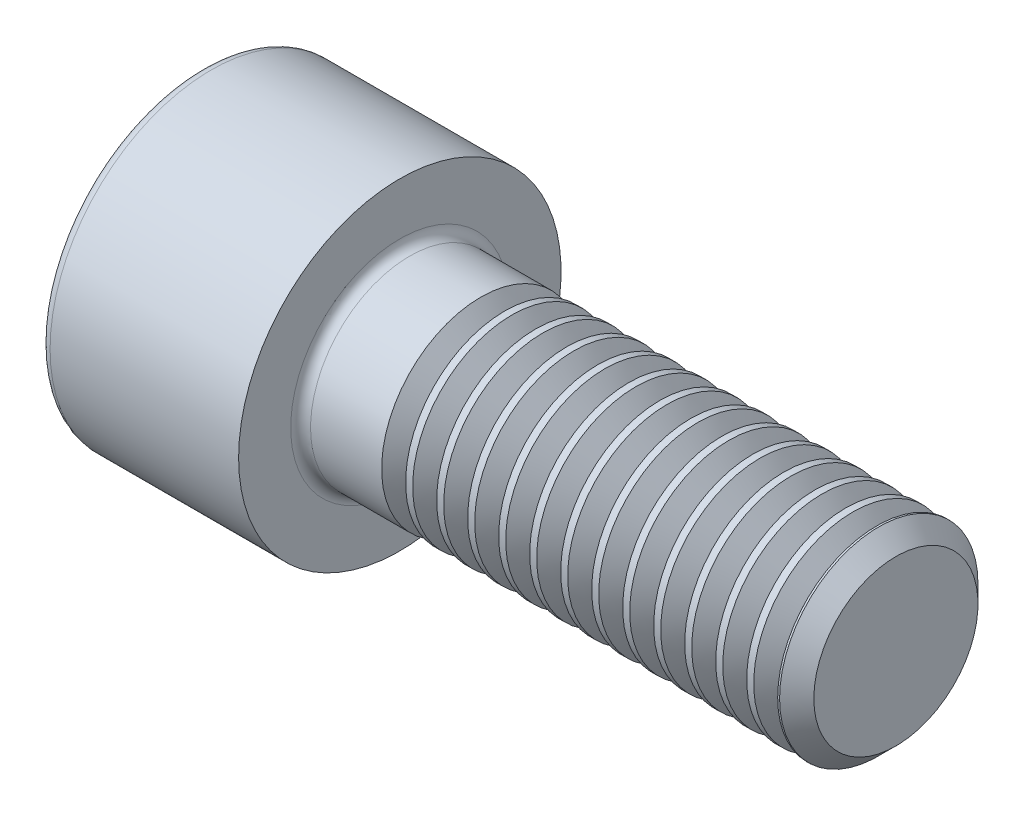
ISO-10303-21;
HEADER;
FILE_DESCRIPTION(('STEP AP214'),'2;1');
FILE_NAME('part.step','',(''),(''),'','','');
FILE_SCHEMA(('AUTOMOTIVE_DESIGN { 1 0 10303 214 1 1 1 1 }'));
ENDSEC;
DATA;
#1=APPLICATION_CONTEXT('core data for automotive mechanical design processes');
#2=APPLICATION_PROTOCOL_DEFINITION('international standard','automotive_design',2000,#1);
#3=PRODUCT_CONTEXT('',#1,'mechanical');
#4=PRODUCT('Part','Part','',(#3));
#5=PRODUCT_RELATED_PRODUCT_CATEGORY('part','',(#4));
#6=PRODUCT_DEFINITION_FORMATION('','',#4);
#7=PRODUCT_DEFINITION_CONTEXT('part definition',#1,'design');
#8=PRODUCT_DEFINITION('design','',#6,#7);
#9=PRODUCT_DEFINITION_SHAPE('','',#8);
#10=(LENGTH_UNIT() NAMED_UNIT(*) SI_UNIT(.MILLI.,.METRE.));
#11=(NAMED_UNIT(*) PLANE_ANGLE_UNIT() SI_UNIT($,.RADIAN.));
#12=(NAMED_UNIT(*) SI_UNIT($,.STERADIAN.) SOLID_ANGLE_UNIT());
#13=UNCERTAINTY_MEASURE_WITH_UNIT(LENGTH_MEASURE(1.E-05),#10,'distance_accuracy_value','');
#14=(GEOMETRIC_REPRESENTATION_CONTEXT(3) GLOBAL_UNCERTAINTY_ASSIGNED_CONTEXT((#13)) GLOBAL_UNIT_ASSIGNED_CONTEXT((#10,
#11,#12)) REPRESENTATION_CONTEXT('',''));
#15=CARTESIAN_POINT('',(0.,0.,0.));
#16=DIRECTION('',(0.,0.,1.));
#17=DIRECTION('',(1.,0.,0.));
#18=AXIS2_PLACEMENT_3D('',#15,#16,#17);
#19=CARTESIAN_POINT('',(0.,0.,0.));
#20=DIRECTION('',(-1.,0.,0.));
#21=DIRECTION('',(0.,0.,1.));
#22=AXIS2_PLACEMENT_3D('',#19,#20,#21);
#23=PLANE('',#22);
#24=DIRECTION('',(0.,-0.499999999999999,0.866025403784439));
#25=VECTOR('',#24,1.);
#26=CARTESIAN_POINT('',(0.,3.51894989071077,0.));
#27=LINE('',#26,#25);
#28=CARTESIAN_POINT('',(0.,3.51894989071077,0.));
#29=VERTEX_POINT('',#28);
#30=CARTESIAN_POINT('',(0.,1.75947494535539,3.04749999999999));
#31=VERTEX_POINT('',#30);
#32=EDGE_CURVE('E110',#29,#31,#27,.T.);
#33=ORIENTED_EDGE('',*,*,#32,.T.);
#34=DIRECTION('',(0.,1.,0.));
#35=VECTOR('',#34,1.);
#36=CARTESIAN_POINT('',(0.,-1.75947494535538,3.0475));
#37=LINE('',#36,#35);
#38=CARTESIAN_POINT('',(0.,-1.75947494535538,3.0475));
#39=VERTEX_POINT('',#38);
#40=EDGE_CURVE('E99',#39,#31,#37,.T.);
#41=ORIENTED_EDGE('',*,*,#40,.F.);
#42=DIRECTION('',(0.,-0.500000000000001,-0.866025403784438));
#43=VECTOR('',#42,1.);
#44=CARTESIAN_POINT('',(0.,-1.75947494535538,3.0475));
#45=LINE('',#44,#43);
#46=CARTESIAN_POINT('',(0.,-3.51894989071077,0.));
#47=VERTEX_POINT('',#46);
#48=EDGE_CURVE('E109',#39,#47,#45,.T.);
#49=ORIENTED_EDGE('',*,*,#48,.T.);
#50=DIRECTION('',(0.,0.499999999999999,-0.866025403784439));
#51=VECTOR('',#50,1.);
#52=CARTESIAN_POINT('',(0.,-3.51894989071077,0.));
#53=LINE('',#52,#51);
#54=CARTESIAN_POINT('',(0.,-1.75947494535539,-3.0475));
#55=VERTEX_POINT('',#54);
#56=EDGE_CURVE('E133',#47,#55,#53,.T.);
#57=ORIENTED_EDGE('',*,*,#56,.T.);
#58=DIRECTION('',(0.,-1.,0.));
#59=VECTOR('',#58,1.);
#60=CARTESIAN_POINT('',(0.,1.75947494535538,-3.04750000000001));
#61=LINE('',#60,#59);
#62=CARTESIAN_POINT('',(0.,1.75947494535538,-3.04750000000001));
#63=VERTEX_POINT('',#62);
#64=EDGE_CURVE('E136',#63,#55,#61,.T.);
#65=ORIENTED_EDGE('',*,*,#64,.F.);
#66=DIRECTION('',(0.,-0.500000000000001,-0.866025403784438));
#67=VECTOR('',#66,1.);
#68=CARTESIAN_POINT('',(0.,3.51894989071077,0.));
#69=LINE('',#68,#67);
#70=EDGE_CURVE('E124',#29,#63,#69,.T.);
#71=ORIENTED_EDGE('',*,*,#70,.F.);
#72=EDGE_LOOP('',(#33,#41,#49,#57,#65,#71));
#73=FACE_BOUND('',#72,.T.);
#74=CARTESIAN_POINT('',(0.,0.,0.));
#75=DIRECTION('',(-1.,0.,0.));
#76=DIRECTION('',(0.,0.,1.));
#77=AXIS2_PLACEMENT_3D('',#74,#75,#76);
#78=CIRCLE('',#77,6.1);
#79=CARTESIAN_POINT('',(0.,0.,6.1));
#80=VERTEX_POINT('',#79);
#81=EDGE_CURVE('E35',#80,#80,#78,.T.);
#82=ORIENTED_EDGE('',*,*,#81,.T.);
#83=EDGE_LOOP('',(#82));
#84=FACE_BOUND('',#83,.T.);
#85=ADVANCED_FACE('F28',(#73,#84),#23,.T.);
#86=CARTESIAN_POINT('',(-31.75,0.,0.));
#87=DIRECTION('',(-1.,0.,0.));
#88=DIRECTION('',(0.,0.,1.));
#89=AXIS2_PLACEMENT_3D('',#86,#87,#88);
#90=CYLINDRICAL_SURFACE('',#89,6.5);
#91=CARTESIAN_POINT('',(0.399999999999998,0.,0.));
#92=DIRECTION('',(-1.,0.,0.));
#93=DIRECTION('',(0.,0.,1.));
#94=AXIS2_PLACEMENT_3D('',#91,#92,#93);
#95=CIRCLE('',#94,6.5);
#96=CARTESIAN_POINT('',(0.399999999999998,0.,6.5));
#97=VERTEX_POINT('',#96);
#98=EDGE_CURVE('E11',#97,#97,#95,.F.);
#99=ORIENTED_EDGE('',*,*,#98,.T.);
#100=EDGE_LOOP('',(#99));
#101=FACE_BOUND('',#100,.T.);
#102=CARTESIAN_POINT('',(8.00000000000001,0.,0.));
#103=DIRECTION('',(-1.,0.,0.));
#104=DIRECTION('',(0.,0.,1.));
#105=AXIS2_PLACEMENT_3D('',#102,#103,#104);
#106=CIRCLE('',#105,6.5);
#107=CARTESIAN_POINT('',(8.00000000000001,0.,6.5));
#108=VERTEX_POINT('',#107);
#109=EDGE_CURVE('E181',#108,#108,#106,.T.);
#110=ORIENTED_EDGE('',*,*,#109,.T.);
#111=EDGE_LOOP('',(#110));
#112=FACE_BOUND('',#111,.T.);
#113=ADVANCED_FACE('F209',(#101,#112),#90,.T.);
#114=CARTESIAN_POINT('',(8.,6.5,0.));
#115=DIRECTION('',(1.,0.,0.));
#116=DIRECTION('',(0.,0.,-1.));
#117=AXIS2_PLACEMENT_3D('',#114,#115,#116);
#118=PLANE('',#117);
#119=CARTESIAN_POINT('',(8.,0.,0.));
#120=DIRECTION('',(1.,0.,0.));
#121=DIRECTION('',(0.,0.,-1.));
#122=AXIS2_PLACEMENT_3D('',#119,#120,#121);
#123=CIRCLE('',#122,4.4);
#124=CARTESIAN_POINT('',(8.,0.,-4.4));
#125=VERTEX_POINT('',#124);
#126=EDGE_CURVE('E184',#125,#125,#123,.F.);
#127=ORIENTED_EDGE('',*,*,#126,.T.);
#128=EDGE_LOOP('',(#127));
#129=FACE_BOUND('',#128,.T.);
#130=ORIENTED_EDGE('',*,*,#109,.F.);
#131=EDGE_LOOP('',(#130));
#132=FACE_BOUND('',#131,.T.);
#133=ADVANCED_FACE('F212',(#129,#132),#118,.T.);
#134=CARTESIAN_POINT('',(-31.75,0.,0.));
#135=DIRECTION('',(-1.,0.,0.));
#136=DIRECTION('',(0.,0.,1.));
#137=AXIS2_PLACEMENT_3D('',#134,#135,#136);
#138=CYLINDRICAL_SURFACE('',#137,4.);
#139=CARTESIAN_POINT('',(11.2665066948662,0.,0.));
#140=DIRECTION('',(-1.,0.,0.));
#141=DIRECTION('',(0.,-1.,0.));
#142=AXIS2_PLACEMENT_3D('',#139,#140,#141);
#143=CIRCLE('',#142,4.);
#144=CARTESIAN_POINT('',(11.2665066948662,-4.,0.));
#145=VERTEX_POINT('',#144);
#146=EDGE_CURVE('E128',#145,#145,#143,.T.);
#147=ORIENTED_EDGE('',*,*,#146,.T.);
#148=EDGE_LOOP('',(#147));
#149=FACE_BOUND('',#148,.T.);
#150=CARTESIAN_POINT('',(8.4,0.,0.));
#151=DIRECTION('',(1.,0.,0.));
#152=DIRECTION('',(0.,0.,-1.));
#153=AXIS2_PLACEMENT_3D('',#150,#151,#152);
#154=CIRCLE('',#153,4.);
#155=CARTESIAN_POINT('',(8.4,0.,-4.));
#156=VERTEX_POINT('',#155);
#157=EDGE_CURVE('E187',#156,#156,#154,.T.);
#158=ORIENTED_EDGE('',*,*,#157,.T.);
#159=EDGE_LOOP('',(#158));
#160=FACE_BOUND('',#159,.T.);
#161=ADVANCED_FACE('F204',(#149,#160),#138,.T.);
#162=CARTESIAN_POINT('',(8.4,0.,0.));
#163=DIRECTION('',(1.,0.,0.));
#164=DIRECTION('',(0.,0.,-1.));
#165=AXIS2_PLACEMENT_3D('',#162,#163,#164);
#166=TOROIDAL_SURFACE('',#165,4.4,0.4);
#167=ORIENTED_EDGE('',*,*,#157,.F.);
#168=EDGE_LOOP('',(#167));
#169=FACE_BOUND('',#168,.T.);
#170=ORIENTED_EDGE('',*,*,#126,.F.);
#171=EDGE_LOOP('',(#170));
#172=FACE_BOUND('',#171,.T.);
#173=ADVANCED_FACE('F194',(#169,#172),#166,.F.);
#174=CARTESIAN_POINT('',(0.399999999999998,0.,0.));
#175=DIRECTION('',(-1.,0.,0.));
#176=DIRECTION('',(0.,0.,1.));
#177=AXIS2_PLACEMENT_3D('',#174,#175,#176);
#178=TOROIDAL_SURFACE('',#177,6.1,0.4);
#179=ORIENTED_EDGE('',*,*,#98,.F.);
#180=EDGE_LOOP('',(#179));
#181=FACE_BOUND('',#180,.T.);
#182=ORIENTED_EDGE('',*,*,#81,.F.);
#183=EDGE_LOOP('',(#182));
#184=FACE_BOUND('',#183,.T.);
#185=ADVANCED_FACE('F192',(#181,#184),#178,.T.);
#186=CARTESIAN_POINT('',(4.,3.51894989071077,0.));
#187=DIRECTION('',(0.,-0.866025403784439,-0.499999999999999));
#188=DIRECTION('',(0.,0.499999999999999,-0.866025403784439));
#189=AXIS2_PLACEMENT_3D('',#186,#187,#188);
#190=PLANE('',#189);
#191=ORIENTED_EDGE('',*,*,#32,.F.);
#192=DIRECTION('',(-1.,0.,0.));
#193=VECTOR('',#192,1.);
#194=CARTESIAN_POINT('',(4.,3.51894989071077,0.));
#195=LINE('',#194,#193);
#196=CARTESIAN_POINT('',(4.,3.51894989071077,0.));
#197=VERTEX_POINT('',#196);
#198=EDGE_CURVE('E159',#197,#29,#195,.T.);
#199=ORIENTED_EDGE('',*,*,#198,.F.);
#200=DIRECTION('',(0.,-0.499999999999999,0.866025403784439));
#201=VECTOR('',#200,1.);
#202=CARTESIAN_POINT('',(4.,3.51894989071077,0.));
#203=LINE('',#202,#201);
#204=CARTESIAN_POINT('',(4.,2.63921241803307,1.52374999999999));
#205=VERTEX_POINT('',#204);
#206=EDGE_CURVE('E139',#197,#205,#203,.T.);
#207=ORIENTED_EDGE('',*,*,#206,.T.);
#208=CARTESIAN_POINT('',(4.,1.75947494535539,3.04749999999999));
#209=VERTEX_POINT('',#208);
#210=EDGE_CURVE('E118',#205,#209,#203,.T.);
#211=ORIENTED_EDGE('',*,*,#210,.T.);
#212=DIRECTION('',(-1.,0.,0.));
#213=VECTOR('',#212,1.);
#214=CARTESIAN_POINT('',(4.,1.75947494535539,3.04749999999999));
#215=LINE('',#214,#213);
#216=EDGE_CURVE('E103',#209,#31,#215,.T.);
#217=ORIENTED_EDGE('',*,*,#216,.T.);
#218=EDGE_LOOP('',(#191,#199,#207,#211,#217));
#219=FACE_BOUND('',#218,.T.);
#220=ADVANCED_FACE('F114',(#219),#190,.T.);
#221=CARTESIAN_POINT('',(4.,-1.75947494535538,3.0475));
#222=DIRECTION('',(0.,0.,1.));
#223=DIRECTION('',(0.,-1.,0.));
#224=AXIS2_PLACEMENT_3D('',#221,#222,#223);
#225=PLANE('',#224);
#226=ORIENTED_EDGE('',*,*,#40,.T.);
#227=ORIENTED_EDGE('',*,*,#216,.F.);
#228=DIRECTION('',(0.,1.,0.));
#229=VECTOR('',#228,1.);
#230=CARTESIAN_POINT('',(4.,-1.75947494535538,3.0475));
#231=LINE('',#230,#229);
#232=CARTESIAN_POINT('',(4.,0.,3.0475));
#233=VERTEX_POINT('',#232);
#234=EDGE_CURVE('E141',#233,#209,#231,.T.);
#235=ORIENTED_EDGE('',*,*,#234,.F.);
#236=CARTESIAN_POINT('',(4.,-1.75947494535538,3.0475));
#237=VERTEX_POINT('',#236);
#238=EDGE_CURVE('E142',#237,#233,#231,.T.);
#239=ORIENTED_EDGE('',*,*,#238,.F.);
#240=DIRECTION('',(-1.,0.,0.));
#241=VECTOR('',#240,1.);
#242=CARTESIAN_POINT('',(4.,-1.75947494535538,3.0475));
#243=LINE('',#242,#241);
#244=EDGE_CURVE('E105',#237,#39,#243,.T.);
#245=ORIENTED_EDGE('',*,*,#244,.T.);
#246=EDGE_LOOP('',(#226,#227,#235,#239,#245));
#247=FACE_BOUND('',#246,.T.);
#248=ADVANCED_FACE('F101',(#247),#225,.F.);
#249=CARTESIAN_POINT('',(4.,-1.75947494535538,3.0475));
#250=DIRECTION('',(0.,0.866025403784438,-0.500000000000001));
#251=DIRECTION('',(0.,0.500000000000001,0.866025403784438));
#252=AXIS2_PLACEMENT_3D('',#249,#250,#251);
#253=PLANE('',#252);
#254=ORIENTED_EDGE('',*,*,#48,.F.);
#255=ORIENTED_EDGE('',*,*,#244,.F.);
#256=DIRECTION('',(0.,-0.500000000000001,-0.866025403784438));
#257=VECTOR('',#256,1.);
#258=CARTESIAN_POINT('',(4.,-1.75947494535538,3.0475));
#259=LINE('',#258,#257);
#260=CARTESIAN_POINT('',(4.,-2.63921241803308,1.52375));
#261=VERTEX_POINT('',#260);
#262=EDGE_CURVE('E146',#237,#261,#259,.T.);
#263=ORIENTED_EDGE('',*,*,#262,.T.);
#264=CARTESIAN_POINT('',(4.,-3.51894989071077,0.));
#265=VERTEX_POINT('',#264);
#266=EDGE_CURVE('E145',#261,#265,#259,.T.);
#267=ORIENTED_EDGE('',*,*,#266,.T.);
#268=DIRECTION('',(-1.,0.,0.));
#269=VECTOR('',#268,1.);
#270=CARTESIAN_POINT('',(4.,-3.51894989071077,0.));
#271=LINE('',#270,#269);
#272=EDGE_CURVE('E167',#265,#47,#271,.T.);
#273=ORIENTED_EDGE('',*,*,#272,.T.);
#274=EDGE_LOOP('',(#254,#255,#263,#267,#273));
#275=FACE_BOUND('',#274,.T.);
#276=ADVANCED_FACE('F376',(#275),#253,.T.);
#277=CARTESIAN_POINT('',(4.,-3.51894989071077,0.));
#278=DIRECTION('',(0.,0.866025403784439,0.499999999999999));
#279=DIRECTION('',(0.,-0.499999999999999,0.866025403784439));
#280=AXIS2_PLACEMENT_3D('',#277,#278,#279);
#281=PLANE('',#280);
#282=ORIENTED_EDGE('',*,*,#56,.F.);
#283=ORIENTED_EDGE('',*,*,#272,.F.);
#284=DIRECTION('',(0.,0.499999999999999,-0.866025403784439));
#285=VECTOR('',#284,1.);
#286=CARTESIAN_POINT('',(4.,-3.51894989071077,0.));
#287=LINE('',#286,#285);
#288=CARTESIAN_POINT('',(4.,-2.63921241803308,-1.52375));
#289=VERTEX_POINT('',#288);
#290=EDGE_CURVE('E150',#265,#289,#287,.T.);
#291=ORIENTED_EDGE('',*,*,#290,.T.);
#292=CARTESIAN_POINT('',(4.,-1.75947494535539,-3.0475));
#293=VERTEX_POINT('',#292);
#294=EDGE_CURVE('E149',#289,#293,#287,.T.);
#295=ORIENTED_EDGE('',*,*,#294,.T.);
#296=DIRECTION('',(-1.,0.,0.));
#297=VECTOR('',#296,1.);
#298=CARTESIAN_POINT('',(4.,-1.75947494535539,-3.0475));
#299=LINE('',#298,#297);
#300=EDGE_CURVE('E164',#293,#55,#299,.T.);
#301=ORIENTED_EDGE('',*,*,#300,.T.);
#302=EDGE_LOOP('',(#282,#283,#291,#295,#301));
#303=FACE_BOUND('',#302,.T.);
#304=ADVANCED_FACE('F372',(#303),#281,.T.);
#305=CARTESIAN_POINT('',(4.,1.75947494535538,-3.04750000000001));
#306=DIRECTION('',(0.,0.,-1.));
#307=DIRECTION('',(0.,1.,0.));
#308=AXIS2_PLACEMENT_3D('',#305,#306,#307);
#309=PLANE('',#308);
#310=ORIENTED_EDGE('',*,*,#64,.T.);
#311=ORIENTED_EDGE('',*,*,#300,.F.);
#312=DIRECTION('',(0.,-1.,0.));
#313=VECTOR('',#312,1.);
#314=CARTESIAN_POINT('',(4.,1.75947494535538,-3.04750000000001));
#315=LINE('',#314,#313);
#316=CARTESIAN_POINT('',(4.,0.,-3.0475));
#317=VERTEX_POINT('',#316);
#318=EDGE_CURVE('E153',#317,#293,#315,.T.);
#319=ORIENTED_EDGE('',*,*,#318,.F.);
#320=CARTESIAN_POINT('',(4.,1.75947494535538,-3.04750000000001));
#321=VERTEX_POINT('',#320);
#322=EDGE_CURVE('E42',#321,#317,#315,.T.);
#323=ORIENTED_EDGE('',*,*,#322,.F.);
#324=DIRECTION('',(-1.,0.,0.));
#325=VECTOR('',#324,1.);
#326=CARTESIAN_POINT('',(4.,1.75947494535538,-3.04750000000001));
#327=LINE('',#326,#325);
#328=EDGE_CURVE('E161',#321,#63,#327,.T.);
#329=ORIENTED_EDGE('',*,*,#328,.T.);
#330=EDGE_LOOP('',(#310,#311,#319,#323,#329));
#331=FACE_BOUND('',#330,.T.);
#332=ADVANCED_FACE('F368',(#331),#309,.F.);
#333=CARTESIAN_POINT('',(4.,3.51894989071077,0.));
#334=DIRECTION('',(0.,0.866025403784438,-0.500000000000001));
#335=DIRECTION('',(0.,0.500000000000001,0.866025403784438));
#336=AXIS2_PLACEMENT_3D('',#333,#334,#335);
#337=PLANE('',#336);
#338=ORIENTED_EDGE('',*,*,#70,.T.);
#339=ORIENTED_EDGE('',*,*,#328,.F.);
#340=DIRECTION('',(0.,-0.500000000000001,-0.866025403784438));
#341=VECTOR('',#340,1.);
#342=CARTESIAN_POINT('',(4.,3.51894989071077,0.));
#343=LINE('',#342,#341);
#344=CARTESIAN_POINT('',(4.,2.63921241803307,-1.52375));
#345=VERTEX_POINT('',#344);
#346=EDGE_CURVE('E155',#345,#321,#343,.T.);
#347=ORIENTED_EDGE('',*,*,#346,.F.);
#348=EDGE_CURVE('E156',#197,#345,#343,.T.);
#349=ORIENTED_EDGE('',*,*,#348,.F.);
#350=ORIENTED_EDGE('',*,*,#198,.T.);
#351=EDGE_LOOP('',(#338,#339,#347,#349,#350));
#352=FACE_BOUND('',#351,.T.);
#353=ADVANCED_FACE('F363',(#352),#337,.F.);
#354=CARTESIAN_POINT('',(4.,5.27842483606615,-3.04750000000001));
#355=DIRECTION('',(1.,0.,0.));
#356=DIRECTION('',(0.,0.,-1.));
#357=AXIS2_PLACEMENT_3D('',#354,#355,#356);
#358=PLANE('',#357);
#359=ORIENTED_EDGE('',*,*,#318,.T.);
#360=ORIENTED_EDGE('',*,*,#294,.F.);
#361=CARTESIAN_POINT('',(4.,0.,0.));
#362=DIRECTION('',(-1.,0.,0.));
#363=DIRECTION('',(0.,0.,1.));
#364=AXIS2_PLACEMENT_3D('',#361,#362,#363);
#365=CIRCLE('',#364,3.0475);
#366=EDGE_CURVE('E402',#317,#289,#365,.T.);
#367=ORIENTED_EDGE('',*,*,#366,.F.);
#368=EDGE_LOOP('',(#359,#360,#367));
#369=FACE_BOUND('',#368,.T.);
#370=ADVANCED_FACE('F359',(#369),#358,.F.);
#371=ORIENTED_EDGE('',*,*,#290,.F.);
#372=ORIENTED_EDGE('',*,*,#266,.F.);
#373=EDGE_CURVE('E400',#289,#261,#365,.T.);
#374=ORIENTED_EDGE('',*,*,#373,.F.);
#375=EDGE_LOOP('',(#371,#372,#374));
#376=FACE_BOUND('',#375,.T.);
#377=ADVANCED_FACE('F362',(#376),#358,.F.);
#378=ORIENTED_EDGE('',*,*,#262,.F.);
#379=ORIENTED_EDGE('',*,*,#238,.T.);
#380=EDGE_CURVE('E119',#261,#233,#365,.T.);
#381=ORIENTED_EDGE('',*,*,#380,.F.);
#382=EDGE_LOOP('',(#378,#379,#381));
#383=FACE_BOUND('',#382,.T.);
#384=ADVANCED_FACE('F396',(#383),#358,.F.);
#385=ORIENTED_EDGE('',*,*,#234,.T.);
#386=ORIENTED_EDGE('',*,*,#210,.F.);
#387=EDGE_CURVE('E171',#233,#205,#365,.T.);
#388=ORIENTED_EDGE('',*,*,#387,.F.);
#389=EDGE_LOOP('',(#385,#386,#388));
#390=FACE_BOUND('',#389,.T.);
#391=ADVANCED_FACE('F393',(#390),#358,.F.);
#392=ORIENTED_EDGE('',*,*,#206,.F.);
#393=ORIENTED_EDGE('',*,*,#348,.T.);
#394=EDGE_CURVE('E175',#205,#345,#365,.T.);
#395=ORIENTED_EDGE('',*,*,#394,.F.);
#396=EDGE_LOOP('',(#392,#393,#395));
#397=FACE_BOUND('',#396,.T.);
#398=ADVANCED_FACE('F386',(#397),#358,.F.);
#399=ORIENTED_EDGE('',*,*,#346,.T.);
#400=ORIENTED_EDGE('',*,*,#322,.T.);
#401=EDGE_CURVE('E406',#345,#317,#365,.T.);
#402=ORIENTED_EDGE('',*,*,#401,.F.);
#403=EDGE_LOOP('',(#399,#400,#402));
#404=FACE_BOUND('',#403,.T.);
#405=ADVANCED_FACE('F365',(#404),#358,.F.);
#406=CARTESIAN_POINT('',(4.,0.,0.));
#407=DIRECTION('',(-1.,0.,0.));
#408=DIRECTION('',(0.,0.,1.));
#409=AXIS2_PLACEMENT_3D('',#406,#407,#408);
#410=CONICAL_SURFACE('',#409,3.0475,1.04719755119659);
#411=CARTESIAN_POINT('',(5.75947494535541,0.,0.));
#412=VERTEX_POINT('',#411);
#413=VERTEX_LOOP('',#412);
#414=FACE_BOUND('',#413,.T.);
#415=ORIENTED_EDGE('',*,*,#387,.T.);
#416=ORIENTED_EDGE('',*,*,#394,.T.);
#417=ORIENTED_EDGE('',*,*,#401,.T.);
#418=ORIENTED_EDGE('',*,*,#366,.T.);
#419=ORIENTED_EDGE('',*,*,#373,.T.);
#420=ORIENTED_EDGE('',*,*,#380,.T.);
#421=EDGE_LOOP('',(#415,#416,#417,#418,#419,#420));
#422=FACE_BOUND('',#421,.T.);
#423=ADVANCED_FACE('F357',(#414,#422),#410,.F.);
#424=CARTESIAN_POINT('',(12.2334933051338,0.,0.));
#425=DIRECTION('',(1.,0.,0.));
#426=DIRECTION('',(0.,1.,0.));
#427=AXIS2_PLACEMENT_3D('',#424,#425,#426);
#428=CONICAL_SURFACE('',#427,4.,0.959931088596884);
#429=CARTESIAN_POINT('',(11.75,0.,0.));
#430=DIRECTION('',(-1.,0.,0.));
#431=DIRECTION('',(0.,-1.,0.));
#432=AXIS2_PLACEMENT_3D('',#429,#430,#431);
#433=CIRCLE('',#432,3.3095);
#434=CARTESIAN_POINT('',(11.75,-3.3095,0.));
#435=VERTEX_POINT('',#434);
#436=EDGE_CURVE('E723',#435,#435,#433,.T.);
#437=ORIENTED_EDGE('',*,*,#436,.F.);
#438=EDGE_LOOP('',(#437));
#439=FACE_BOUND('',#438,.T.);
#440=CARTESIAN_POINT('',(12.2334933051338,0.,0.));
#441=DIRECTION('',(-1.,0.,0.));
#442=DIRECTION('',(0.,-1.,0.));
#443=AXIS2_PLACEMENT_3D('',#440,#441,#442);
#444=CIRCLE('',#443,4.);
#445=CARTESIAN_POINT('',(12.2334933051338,-4.,0.));
#446=VERTEX_POINT('',#445);
#447=EDGE_CURVE('E125',#446,#446,#444,.T.);
#448=ORIENTED_EDGE('',*,*,#447,.T.);
#449=EDGE_LOOP('',(#448));
#450=FACE_BOUND('',#449,.T.);
#451=ADVANCED_FACE('F353',(#439,#450),#428,.T.);
#452=CARTESIAN_POINT('',(11.75,0.,0.));
#453=DIRECTION('',(-1.,0.,0.));
#454=DIRECTION('',(0.,-1.,0.));
#455=AXIS2_PLACEMENT_3D('',#452,#453,#454);
#456=CONICAL_SURFACE('',#455,3.3095,0.959931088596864);
#457=ORIENTED_EDGE('',*,*,#146,.F.);
#458=EDGE_LOOP('',(#457));
#459=FACE_BOUND('',#458,.T.);
#460=ORIENTED_EDGE('',*,*,#436,.T.);
#461=EDGE_LOOP('',(#460));
#462=FACE_BOUND('',#461,.T.);
#463=ADVANCED_FACE('F350',(#459,#462),#456,.T.);
#464=CARTESIAN_POINT('',(12.5165066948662,0.,0.));
#465=DIRECTION('',(-1.,0.,0.));
#466=DIRECTION('',(0.,-1.,0.));
#467=AXIS2_PLACEMENT_3D('',#464,#465,#466);
#468=CIRCLE('',#467,4.);
#469=CARTESIAN_POINT('',(12.5165066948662,-4.,0.));
#470=VERTEX_POINT('',#469);
#471=EDGE_CURVE('E717',#470,#470,#468,.T.);
#472=ORIENTED_EDGE('',*,*,#471,.T.);
#473=EDGE_LOOP('',(#472));
#474=FACE_BOUND('',#473,.T.);
#475=ORIENTED_EDGE('',*,*,#447,.F.);
#476=EDGE_LOOP('',(#475));
#477=FACE_BOUND('',#476,.T.);
#478=ADVANCED_FACE('F225',(#474,#477),#138,.T.);
#479=CARTESIAN_POINT('',(13.4834933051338,0.,0.));
#480=DIRECTION('',(1.,0.,0.));
#481=DIRECTION('',(0.,1.,0.));
#482=AXIS2_PLACEMENT_3D('',#479,#480,#481);
#483=CONICAL_SURFACE('',#482,4.,0.959931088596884);
#484=CARTESIAN_POINT('',(13.,0.,0.));
#485=DIRECTION('',(-1.,0.,0.));
#486=DIRECTION('',(0.,-1.,0.));
#487=AXIS2_PLACEMENT_3D('',#484,#485,#486);
#488=CIRCLE('',#487,3.3095);
#489=CARTESIAN_POINT('',(13.,-3.3095,0.));
#490=VERTEX_POINT('',#489);
#491=EDGE_CURVE('E714',#490,#490,#488,.T.);
#492=ORIENTED_EDGE('',*,*,#491,.F.);
#493=EDGE_LOOP('',(#492));
#494=FACE_BOUND('',#493,.T.);
#495=CARTESIAN_POINT('',(13.4834933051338,0.,0.));
#496=DIRECTION('',(-1.,0.,0.));
#497=DIRECTION('',(0.,-1.,0.));
#498=AXIS2_PLACEMENT_3D('',#495,#496,#497);
#499=CIRCLE('',#498,4.);
#500=CARTESIAN_POINT('',(13.4834933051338,-4.,0.));
#501=VERTEX_POINT('',#500);
#502=EDGE_CURVE('E720',#501,#501,#499,.T.);
#503=ORIENTED_EDGE('',*,*,#502,.T.);
#504=EDGE_LOOP('',(#503));
#505=FACE_BOUND('',#504,.T.);
#506=ADVANCED_FACE('F345',(#494,#505),#483,.T.);
#507=CARTESIAN_POINT('',(13.,0.,0.));
#508=DIRECTION('',(-1.,0.,0.));
#509=DIRECTION('',(0.,-1.,0.));
#510=AXIS2_PLACEMENT_3D('',#507,#508,#509);
#511=CONICAL_SURFACE('',#510,3.3095,0.959931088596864);
#512=ORIENTED_EDGE('',*,*,#471,.F.);
#513=EDGE_LOOP('',(#512));
#514=FACE_BOUND('',#513,.T.);
#515=ORIENTED_EDGE('',*,*,#491,.T.);
#516=EDGE_LOOP('',(#515));
#517=FACE_BOUND('',#516,.T.);
#518=ADVANCED_FACE('F342',(#514,#517),#511,.T.);
#519=CARTESIAN_POINT('',(13.7665066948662,0.,0.));
#520=DIRECTION('',(-1.,0.,0.));
#521=DIRECTION('',(0.,-1.,0.));
#522=AXIS2_PLACEMENT_3D('',#519,#520,#521);
#523=CIRCLE('',#522,4.);
#524=CARTESIAN_POINT('',(13.7665066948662,-4.,0.));
#525=VERTEX_POINT('',#524);
#526=EDGE_CURVE('E708',#525,#525,#523,.T.);
#527=ORIENTED_EDGE('',*,*,#526,.T.);
#528=EDGE_LOOP('',(#527));
#529=FACE_BOUND('',#528,.T.);
#530=ORIENTED_EDGE('',*,*,#502,.F.);
#531=EDGE_LOOP('',(#530));
#532=FACE_BOUND('',#531,.T.);
#533=ADVANCED_FACE('F340',(#529,#532),#138,.T.);
#534=CARTESIAN_POINT('',(14.7334933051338,0.,0.));
#535=DIRECTION('',(1.,0.,0.));
#536=DIRECTION('',(0.,1.,0.));
#537=AXIS2_PLACEMENT_3D('',#534,#535,#536);
#538=CONICAL_SURFACE('',#537,4.,0.959931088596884);
#539=CARTESIAN_POINT('',(14.25,0.,0.));
#540=DIRECTION('',(-1.,0.,0.));
#541=DIRECTION('',(0.,-1.,0.));
#542=AXIS2_PLACEMENT_3D('',#539,#540,#541);
#543=CIRCLE('',#542,3.3095);
#544=CARTESIAN_POINT('',(14.25,-3.3095,0.));
#545=VERTEX_POINT('',#544);
#546=EDGE_CURVE('E705',#545,#545,#543,.T.);
#547=ORIENTED_EDGE('',*,*,#546,.F.);
#548=EDGE_LOOP('',(#547));
#549=FACE_BOUND('',#548,.T.);
#550=CARTESIAN_POINT('',(14.7334933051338,0.,0.));
#551=DIRECTION('',(-1.,0.,0.));
#552=DIRECTION('',(0.,-1.,0.));
#553=AXIS2_PLACEMENT_3D('',#550,#551,#552);
#554=CIRCLE('',#553,4.);
#555=CARTESIAN_POINT('',(14.7334933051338,-4.,0.));
#556=VERTEX_POINT('',#555);
#557=EDGE_CURVE('E711',#556,#556,#554,.T.);
#558=ORIENTED_EDGE('',*,*,#557,.T.);
#559=EDGE_LOOP('',(#558));
#560=FACE_BOUND('',#559,.T.);
#561=ADVANCED_FACE('F336',(#549,#560),#538,.T.);
#562=CARTESIAN_POINT('',(14.25,0.,0.));
#563=DIRECTION('',(-1.,0.,0.));
#564=DIRECTION('',(0.,-1.,0.));
#565=AXIS2_PLACEMENT_3D('',#562,#563,#564);
#566=CONICAL_SURFACE('',#565,3.3095,0.959931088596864);
#567=ORIENTED_EDGE('',*,*,#526,.F.);
#568=EDGE_LOOP('',(#567));
#569=FACE_BOUND('',#568,.T.);
#570=ORIENTED_EDGE('',*,*,#546,.T.);
#571=EDGE_LOOP('',(#570));
#572=FACE_BOUND('',#571,.T.);
#573=ADVANCED_FACE('F333',(#569,#572),#566,.T.);
#574=CARTESIAN_POINT('',(15.0165066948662,0.,0.));
#575=DIRECTION('',(-1.,0.,0.));
#576=DIRECTION('',(0.,-1.,0.));
#577=AXIS2_PLACEMENT_3D('',#574,#575,#576);
#578=CIRCLE('',#577,4.);
#579=CARTESIAN_POINT('',(15.0165066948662,-4.,0.));
#580=VERTEX_POINT('',#579);
#581=EDGE_CURVE('E699',#580,#580,#578,.T.);
#582=ORIENTED_EDGE('',*,*,#581,.T.);
#583=EDGE_LOOP('',(#582));
#584=FACE_BOUND('',#583,.T.);
#585=ORIENTED_EDGE('',*,*,#557,.F.);
#586=EDGE_LOOP('',(#585));
#587=FACE_BOUND('',#586,.T.);
#588=ADVANCED_FACE('F331',(#584,#587),#138,.T.);
#589=CARTESIAN_POINT('',(15.9834933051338,0.,0.));
#590=DIRECTION('',(1.,0.,0.));
#591=DIRECTION('',(0.,1.,0.));
#592=AXIS2_PLACEMENT_3D('',#589,#590,#591);
#593=CONICAL_SURFACE('',#592,4.,0.959931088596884);
#594=CARTESIAN_POINT('',(15.5,0.,0.));
#595=DIRECTION('',(-1.,0.,0.));
#596=DIRECTION('',(0.,-1.,0.));
#597=AXIS2_PLACEMENT_3D('',#594,#595,#596);
#598=CIRCLE('',#597,3.3095);
#599=CARTESIAN_POINT('',(15.5,-3.3095,0.));
#600=VERTEX_POINT('',#599);
#601=EDGE_CURVE('E696',#600,#600,#598,.T.);
#602=ORIENTED_EDGE('',*,*,#601,.F.);
#603=EDGE_LOOP('',(#602));
#604=FACE_BOUND('',#603,.T.);
#605=CARTESIAN_POINT('',(15.9834933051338,0.,0.));
#606=DIRECTION('',(-1.,0.,0.));
#607=DIRECTION('',(0.,-1.,0.));
#608=AXIS2_PLACEMENT_3D('',#605,#606,#607);
#609=CIRCLE('',#608,4.);
#610=CARTESIAN_POINT('',(15.9834933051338,-4.,0.));
#611=VERTEX_POINT('',#610);
#612=EDGE_CURVE('E702',#611,#611,#609,.T.);
#613=ORIENTED_EDGE('',*,*,#612,.T.);
#614=EDGE_LOOP('',(#613));
#615=FACE_BOUND('',#614,.T.);
#616=ADVANCED_FACE('F327',(#604,#615),#593,.T.);
#617=CARTESIAN_POINT('',(15.5,0.,0.));
#618=DIRECTION('',(-1.,0.,0.));
#619=DIRECTION('',(0.,-1.,0.));
#620=AXIS2_PLACEMENT_3D('',#617,#618,#619);
#621=CONICAL_SURFACE('',#620,3.3095,0.959931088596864);
#622=ORIENTED_EDGE('',*,*,#581,.F.);
#623=EDGE_LOOP('',(#622));
#624=FACE_BOUND('',#623,.T.);
#625=ORIENTED_EDGE('',*,*,#601,.T.);
#626=EDGE_LOOP('',(#625));
#627=FACE_BOUND('',#626,.T.);
#628=ADVANCED_FACE('F324',(#624,#627),#621,.T.);
#629=CARTESIAN_POINT('',(16.2665066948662,0.,0.));
#630=DIRECTION('',(-1.,0.,0.));
#631=DIRECTION('',(0.,-1.,0.));
#632=AXIS2_PLACEMENT_3D('',#629,#630,#631);
#633=CIRCLE('',#632,4.);
#634=CARTESIAN_POINT('',(16.2665066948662,-4.,0.));
#635=VERTEX_POINT('',#634);
#636=EDGE_CURVE('E690',#635,#635,#633,.T.);
#637=ORIENTED_EDGE('',*,*,#636,.T.);
#638=EDGE_LOOP('',(#637));
#639=FACE_BOUND('',#638,.T.);
#640=ORIENTED_EDGE('',*,*,#612,.F.);
#641=EDGE_LOOP('',(#640));
#642=FACE_BOUND('',#641,.T.);
#643=ADVANCED_FACE('F322',(#639,#642),#138,.T.);
#644=CARTESIAN_POINT('',(17.2334933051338,0.,0.));
#645=DIRECTION('',(1.,0.,0.));
#646=DIRECTION('',(0.,1.,0.));
#647=AXIS2_PLACEMENT_3D('',#644,#645,#646);
#648=CONICAL_SURFACE('',#647,4.,0.959931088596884);
#649=CARTESIAN_POINT('',(16.75,0.,0.));
#650=DIRECTION('',(-1.,0.,0.));
#651=DIRECTION('',(0.,-1.,0.));
#652=AXIS2_PLACEMENT_3D('',#649,#650,#651);
#653=CIRCLE('',#652,3.3095);
#654=CARTESIAN_POINT('',(16.75,-3.3095,0.));
#655=VERTEX_POINT('',#654);
#656=EDGE_CURVE('E687',#655,#655,#653,.T.);
#657=ORIENTED_EDGE('',*,*,#656,.F.);
#658=EDGE_LOOP('',(#657));
#659=FACE_BOUND('',#658,.T.);
#660=CARTESIAN_POINT('',(17.2334933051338,0.,0.));
#661=DIRECTION('',(-1.,0.,0.));
#662=DIRECTION('',(0.,-1.,0.));
#663=AXIS2_PLACEMENT_3D('',#660,#661,#662);
#664=CIRCLE('',#663,4.);
#665=CARTESIAN_POINT('',(17.2334933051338,-4.,0.));
#666=VERTEX_POINT('',#665);
#667=EDGE_CURVE('E693',#666,#666,#664,.T.);
#668=ORIENTED_EDGE('',*,*,#667,.T.);
#669=EDGE_LOOP('',(#668));
#670=FACE_BOUND('',#669,.T.);
#671=ADVANCED_FACE('F318',(#659,#670),#648,.T.);
#672=CARTESIAN_POINT('',(16.75,0.,0.));
#673=DIRECTION('',(-1.,0.,0.));
#674=DIRECTION('',(0.,-1.,0.));
#675=AXIS2_PLACEMENT_3D('',#672,#673,#674);
#676=CONICAL_SURFACE('',#675,3.3095,0.959931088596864);
#677=ORIENTED_EDGE('',*,*,#636,.F.);
#678=EDGE_LOOP('',(#677));
#679=FACE_BOUND('',#678,.T.);
#680=ORIENTED_EDGE('',*,*,#656,.T.);
#681=EDGE_LOOP('',(#680));
#682=FACE_BOUND('',#681,.T.);
#683=ADVANCED_FACE('F315',(#679,#682),#676,.T.);
#684=CARTESIAN_POINT('',(17.5165066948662,0.,0.));
#685=DIRECTION('',(-1.,0.,0.));
#686=DIRECTION('',(0.,-1.,0.));
#687=AXIS2_PLACEMENT_3D('',#684,#685,#686);
#688=CIRCLE('',#687,4.);
#689=CARTESIAN_POINT('',(17.5165066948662,-4.,0.));
#690=VERTEX_POINT('',#689);
#691=EDGE_CURVE('E681',#690,#690,#688,.T.);
#692=ORIENTED_EDGE('',*,*,#691,.T.);
#693=EDGE_LOOP('',(#692));
#694=FACE_BOUND('',#693,.T.);
#695=ORIENTED_EDGE('',*,*,#667,.F.);
#696=EDGE_LOOP('',(#695));
#697=FACE_BOUND('',#696,.T.);
#698=ADVANCED_FACE('F313',(#694,#697),#138,.T.);
#699=CARTESIAN_POINT('',(18.4834933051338,0.,0.));
#700=DIRECTION('',(1.,0.,0.));
#701=DIRECTION('',(0.,1.,0.));
#702=AXIS2_PLACEMENT_3D('',#699,#700,#701);
#703=CONICAL_SURFACE('',#702,4.,0.959931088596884);
#704=CARTESIAN_POINT('',(18.,0.,0.));
#705=DIRECTION('',(-1.,0.,0.));
#706=DIRECTION('',(0.,-1.,0.));
#707=AXIS2_PLACEMENT_3D('',#704,#705,#706);
#708=CIRCLE('',#707,3.3095);
#709=CARTESIAN_POINT('',(18.,-3.3095,0.));
#710=VERTEX_POINT('',#709);
#711=EDGE_CURVE('E678',#710,#710,#708,.T.);
#712=ORIENTED_EDGE('',*,*,#711,.F.);
#713=EDGE_LOOP('',(#712));
#714=FACE_BOUND('',#713,.T.);
#715=CARTESIAN_POINT('',(18.4834933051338,0.,0.));
#716=DIRECTION('',(-1.,0.,0.));
#717=DIRECTION('',(0.,-1.,0.));
#718=AXIS2_PLACEMENT_3D('',#715,#716,#717);
#719=CIRCLE('',#718,4.);
#720=CARTESIAN_POINT('',(18.4834933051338,-4.,0.));
#721=VERTEX_POINT('',#720);
#722=EDGE_CURVE('E684',#721,#721,#719,.T.);
#723=ORIENTED_EDGE('',*,*,#722,.T.);
#724=EDGE_LOOP('',(#723));
#725=FACE_BOUND('',#724,.T.);
#726=ADVANCED_FACE('F309',(#714,#725),#703,.T.);
#727=CARTESIAN_POINT('',(18.,0.,0.));
#728=DIRECTION('',(-1.,0.,0.));
#729=DIRECTION('',(0.,-1.,0.));
#730=AXIS2_PLACEMENT_3D('',#727,#728,#729);
#731=CONICAL_SURFACE('',#730,3.3095,0.959931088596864);
#732=ORIENTED_EDGE('',*,*,#691,.F.);
#733=EDGE_LOOP('',(#732));
#734=FACE_BOUND('',#733,.T.);
#735=ORIENTED_EDGE('',*,*,#711,.T.);
#736=EDGE_LOOP('',(#735));
#737=FACE_BOUND('',#736,.T.);
#738=ADVANCED_FACE('F306',(#734,#737),#731,.T.);
#739=CARTESIAN_POINT('',(18.7665066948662,0.,0.));
#740=DIRECTION('',(-1.,0.,0.));
#741=DIRECTION('',(0.,-1.,0.));
#742=AXIS2_PLACEMENT_3D('',#739,#740,#741);
#743=CIRCLE('',#742,4.);
#744=CARTESIAN_POINT('',(18.7665066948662,-4.,0.));
#745=VERTEX_POINT('',#744);
#746=EDGE_CURVE('E672',#745,#745,#743,.T.);
#747=ORIENTED_EDGE('',*,*,#746,.T.);
#748=EDGE_LOOP('',(#747));
#749=FACE_BOUND('',#748,.T.);
#750=ORIENTED_EDGE('',*,*,#722,.F.);
#751=EDGE_LOOP('',(#750));
#752=FACE_BOUND('',#751,.T.);
#753=ADVANCED_FACE('F304',(#749,#752),#138,.T.);
#754=CARTESIAN_POINT('',(19.7334933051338,0.,0.));
#755=DIRECTION('',(1.,0.,0.));
#756=DIRECTION('',(0.,1.,0.));
#757=AXIS2_PLACEMENT_3D('',#754,#755,#756);
#758=CONICAL_SURFACE('',#757,4.,0.959931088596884);
#759=CARTESIAN_POINT('',(19.25,0.,0.));
#760=DIRECTION('',(-1.,0.,0.));
#761=DIRECTION('',(0.,-1.,0.));
#762=AXIS2_PLACEMENT_3D('',#759,#760,#761);
#763=CIRCLE('',#762,3.3095);
#764=CARTESIAN_POINT('',(19.25,-3.3095,0.));
#765=VERTEX_POINT('',#764);
#766=EDGE_CURVE('E669',#765,#765,#763,.T.);
#767=ORIENTED_EDGE('',*,*,#766,.F.);
#768=EDGE_LOOP('',(#767));
#769=FACE_BOUND('',#768,.T.);
#770=CARTESIAN_POINT('',(19.7334933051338,0.,0.));
#771=DIRECTION('',(-1.,0.,0.));
#772=DIRECTION('',(0.,-1.,0.));
#773=AXIS2_PLACEMENT_3D('',#770,#771,#772);
#774=CIRCLE('',#773,4.);
#775=CARTESIAN_POINT('',(19.7334933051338,-4.,0.));
#776=VERTEX_POINT('',#775);
#777=EDGE_CURVE('E675',#776,#776,#774,.T.);
#778=ORIENTED_EDGE('',*,*,#777,.T.);
#779=EDGE_LOOP('',(#778));
#780=FACE_BOUND('',#779,.T.);
#781=ADVANCED_FACE('F300',(#769,#780),#758,.T.);
#782=CARTESIAN_POINT('',(19.25,0.,0.));
#783=DIRECTION('',(-1.,0.,0.));
#784=DIRECTION('',(0.,-1.,0.));
#785=AXIS2_PLACEMENT_3D('',#782,#783,#784);
#786=CONICAL_SURFACE('',#785,3.3095,0.959931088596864);
#787=ORIENTED_EDGE('',*,*,#746,.F.);
#788=EDGE_LOOP('',(#787));
#789=FACE_BOUND('',#788,.T.);
#790=ORIENTED_EDGE('',*,*,#766,.T.);
#791=EDGE_LOOP('',(#790));
#792=FACE_BOUND('',#791,.T.);
#793=ADVANCED_FACE('F297',(#789,#792),#786,.T.);
#794=CARTESIAN_POINT('',(20.0165066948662,0.,0.));
#795=DIRECTION('',(-1.,0.,0.));
#796=DIRECTION('',(0.,-1.,0.));
#797=AXIS2_PLACEMENT_3D('',#794,#795,#796);
#798=CIRCLE('',#797,4.);
#799=CARTESIAN_POINT('',(20.0165066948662,-4.,0.));
#800=VERTEX_POINT('',#799);
#801=EDGE_CURVE('E663',#800,#800,#798,.T.);
#802=ORIENTED_EDGE('',*,*,#801,.T.);
#803=EDGE_LOOP('',(#802));
#804=FACE_BOUND('',#803,.T.);
#805=ORIENTED_EDGE('',*,*,#777,.F.);
#806=EDGE_LOOP('',(#805));
#807=FACE_BOUND('',#806,.T.);
#808=ADVANCED_FACE('F295',(#804,#807),#138,.T.);
#809=CARTESIAN_POINT('',(20.9834933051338,0.,0.));
#810=DIRECTION('',(1.,0.,0.));
#811=DIRECTION('',(0.,1.,0.));
#812=AXIS2_PLACEMENT_3D('',#809,#810,#811);
#813=CONICAL_SURFACE('',#812,4.,0.959931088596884);
#814=CARTESIAN_POINT('',(20.5,0.,0.));
#815=DIRECTION('',(-1.,0.,0.));
#816=DIRECTION('',(0.,-1.,0.));
#817=AXIS2_PLACEMENT_3D('',#814,#815,#816);
#818=CIRCLE('',#817,3.3095);
#819=CARTESIAN_POINT('',(20.5,-3.3095,0.));
#820=VERTEX_POINT('',#819);
#821=EDGE_CURVE('E660',#820,#820,#818,.T.);
#822=ORIENTED_EDGE('',*,*,#821,.F.);
#823=EDGE_LOOP('',(#822));
#824=FACE_BOUND('',#823,.T.);
#825=CARTESIAN_POINT('',(20.9834933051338,0.,0.));
#826=DIRECTION('',(-1.,0.,0.));
#827=DIRECTION('',(0.,-1.,0.));
#828=AXIS2_PLACEMENT_3D('',#825,#826,#827);
#829=CIRCLE('',#828,4.);
#830=CARTESIAN_POINT('',(20.9834933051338,-4.,0.));
#831=VERTEX_POINT('',#830);
#832=EDGE_CURVE('E666',#831,#831,#829,.T.);
#833=ORIENTED_EDGE('',*,*,#832,.T.);
#834=EDGE_LOOP('',(#833));
#835=FACE_BOUND('',#834,.T.);
#836=ADVANCED_FACE('F291',(#824,#835),#813,.T.);
#837=CARTESIAN_POINT('',(20.5,0.,0.));
#838=DIRECTION('',(-1.,0.,0.));
#839=DIRECTION('',(0.,-1.,0.));
#840=AXIS2_PLACEMENT_3D('',#837,#838,#839);
#841=CONICAL_SURFACE('',#840,3.3095,0.959931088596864);
#842=ORIENTED_EDGE('',*,*,#801,.F.);
#843=EDGE_LOOP('',(#842));
#844=FACE_BOUND('',#843,.T.);
#845=ORIENTED_EDGE('',*,*,#821,.T.);
#846=EDGE_LOOP('',(#845));
#847=FACE_BOUND('',#846,.T.);
#848=ADVANCED_FACE('F288',(#844,#847),#841,.T.);
#849=CARTESIAN_POINT('',(21.2665066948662,0.,0.));
#850=DIRECTION('',(-1.,0.,0.));
#851=DIRECTION('',(0.,-1.,0.));
#852=AXIS2_PLACEMENT_3D('',#849,#850,#851);
#853=CIRCLE('',#852,4.);
#854=CARTESIAN_POINT('',(21.2665066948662,-4.,0.));
#855=VERTEX_POINT('',#854);
#856=EDGE_CURVE('E654',#855,#855,#853,.T.);
#857=ORIENTED_EDGE('',*,*,#856,.T.);
#858=EDGE_LOOP('',(#857));
#859=FACE_BOUND('',#858,.T.);
#860=ORIENTED_EDGE('',*,*,#832,.F.);
#861=EDGE_LOOP('',(#860));
#862=FACE_BOUND('',#861,.T.);
#863=ADVANCED_FACE('F286',(#859,#862),#138,.T.);
#864=CARTESIAN_POINT('',(22.2334933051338,0.,0.));
#865=DIRECTION('',(1.,0.,0.));
#866=DIRECTION('',(0.,1.,0.));
#867=AXIS2_PLACEMENT_3D('',#864,#865,#866);
#868=CONICAL_SURFACE('',#867,4.,0.959931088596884);
#869=CARTESIAN_POINT('',(21.75,0.,0.));
#870=DIRECTION('',(-1.,0.,0.));
#871=DIRECTION('',(0.,-1.,0.));
#872=AXIS2_PLACEMENT_3D('',#869,#870,#871);
#873=CIRCLE('',#872,3.3095);
#874=CARTESIAN_POINT('',(21.75,-3.3095,0.));
#875=VERTEX_POINT('',#874);
#876=EDGE_CURVE('E651',#875,#875,#873,.T.);
#877=ORIENTED_EDGE('',*,*,#876,.F.);
#878=EDGE_LOOP('',(#877));
#879=FACE_BOUND('',#878,.T.);
#880=CARTESIAN_POINT('',(22.2334933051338,0.,0.));
#881=DIRECTION('',(-1.,0.,0.));
#882=DIRECTION('',(0.,-1.,0.));
#883=AXIS2_PLACEMENT_3D('',#880,#881,#882);
#884=CIRCLE('',#883,4.);
#885=CARTESIAN_POINT('',(22.2334933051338,-4.,0.));
#886=VERTEX_POINT('',#885);
#887=EDGE_CURVE('E657',#886,#886,#884,.T.);
#888=ORIENTED_EDGE('',*,*,#887,.T.);
#889=EDGE_LOOP('',(#888));
#890=FACE_BOUND('',#889,.T.);
#891=ADVANCED_FACE('F282',(#879,#890),#868,.T.);
#892=CARTESIAN_POINT('',(21.75,0.,0.));
#893=DIRECTION('',(-1.,0.,0.));
#894=DIRECTION('',(0.,-1.,0.));
#895=AXIS2_PLACEMENT_3D('',#892,#893,#894);
#896=CONICAL_SURFACE('',#895,3.3095,0.959931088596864);
#897=ORIENTED_EDGE('',*,*,#856,.F.);
#898=EDGE_LOOP('',(#897));
#899=FACE_BOUND('',#898,.T.);
#900=ORIENTED_EDGE('',*,*,#876,.T.);
#901=EDGE_LOOP('',(#900));
#902=FACE_BOUND('',#901,.T.);
#903=ADVANCED_FACE('F279',(#899,#902),#896,.T.);
#904=CARTESIAN_POINT('',(22.5165066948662,0.,0.));
#905=DIRECTION('',(-1.,0.,0.));
#906=DIRECTION('',(0.,-1.,0.));
#907=AXIS2_PLACEMENT_3D('',#904,#905,#906);
#908=CIRCLE('',#907,4.);
#909=CARTESIAN_POINT('',(22.5165066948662,-4.,0.));
#910=VERTEX_POINT('',#909);
#911=EDGE_CURVE('E645',#910,#910,#908,.T.);
#912=ORIENTED_EDGE('',*,*,#911,.T.);
#913=EDGE_LOOP('',(#912));
#914=FACE_BOUND('',#913,.T.);
#915=ORIENTED_EDGE('',*,*,#887,.F.);
#916=EDGE_LOOP('',(#915));
#917=FACE_BOUND('',#916,.T.);
#918=ADVANCED_FACE('F277',(#914,#917),#138,.T.);
#919=CARTESIAN_POINT('',(23.4834933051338,0.,0.));
#920=DIRECTION('',(1.,0.,0.));
#921=DIRECTION('',(0.,1.,0.));
#922=AXIS2_PLACEMENT_3D('',#919,#920,#921);
#923=CONICAL_SURFACE('',#922,4.,0.959931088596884);
#924=CARTESIAN_POINT('',(23.,0.,0.));
#925=DIRECTION('',(-1.,0.,0.));
#926=DIRECTION('',(0.,-1.,0.));
#927=AXIS2_PLACEMENT_3D('',#924,#925,#926);
#928=CIRCLE('',#927,3.3095);
#929=CARTESIAN_POINT('',(23.,-3.3095,0.));
#930=VERTEX_POINT('',#929);
#931=EDGE_CURVE('E642',#930,#930,#928,.T.);
#932=ORIENTED_EDGE('',*,*,#931,.F.);
#933=EDGE_LOOP('',(#932));
#934=FACE_BOUND('',#933,.T.);
#935=CARTESIAN_POINT('',(23.4834933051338,0.,0.));
#936=DIRECTION('',(-1.,0.,0.));
#937=DIRECTION('',(0.,-1.,0.));
#938=AXIS2_PLACEMENT_3D('',#935,#936,#937);
#939=CIRCLE('',#938,4.);
#940=CARTESIAN_POINT('',(23.4834933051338,-4.,0.));
#941=VERTEX_POINT('',#940);
#942=EDGE_CURVE('E648',#941,#941,#939,.T.);
#943=ORIENTED_EDGE('',*,*,#942,.T.);
#944=EDGE_LOOP('',(#943));
#945=FACE_BOUND('',#944,.T.);
#946=ADVANCED_FACE('F273',(#934,#945),#923,.T.);
#947=CARTESIAN_POINT('',(23.,0.,0.));
#948=DIRECTION('',(-1.,0.,0.));
#949=DIRECTION('',(0.,-1.,0.));
#950=AXIS2_PLACEMENT_3D('',#947,#948,#949);
#951=CONICAL_SURFACE('',#950,3.3095,0.959931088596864);
#952=ORIENTED_EDGE('',*,*,#911,.F.);
#953=EDGE_LOOP('',(#952));
#954=FACE_BOUND('',#953,.T.);
#955=ORIENTED_EDGE('',*,*,#931,.T.);
#956=EDGE_LOOP('',(#955));
#957=FACE_BOUND('',#956,.T.);
#958=ADVANCED_FACE('F270',(#954,#957),#951,.T.);
#959=CARTESIAN_POINT('',(23.7665066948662,0.,0.));
#960=DIRECTION('',(-1.,0.,0.));
#961=DIRECTION('',(0.,-1.,0.));
#962=AXIS2_PLACEMENT_3D('',#959,#960,#961);
#963=CIRCLE('',#962,4.);
#964=CARTESIAN_POINT('',(23.7665066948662,-4.,0.));
#965=VERTEX_POINT('',#964);
#966=EDGE_CURVE('E636',#965,#965,#963,.T.);
#967=ORIENTED_EDGE('',*,*,#966,.T.);
#968=EDGE_LOOP('',(#967));
#969=FACE_BOUND('',#968,.T.);
#970=ORIENTED_EDGE('',*,*,#942,.F.);
#971=EDGE_LOOP('',(#970));
#972=FACE_BOUND('',#971,.T.);
#973=ADVANCED_FACE('F268',(#969,#972),#138,.T.);
#974=CARTESIAN_POINT('',(24.7334933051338,0.,0.));
#975=DIRECTION('',(1.,0.,0.));
#976=DIRECTION('',(0.,1.,0.));
#977=AXIS2_PLACEMENT_3D('',#974,#975,#976);
#978=CONICAL_SURFACE('',#977,4.,0.959931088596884);
#979=CARTESIAN_POINT('',(24.25,0.,0.));
#980=DIRECTION('',(-1.,0.,0.));
#981=DIRECTION('',(0.,-1.,0.));
#982=AXIS2_PLACEMENT_3D('',#979,#980,#981);
#983=CIRCLE('',#982,3.3095);
#984=CARTESIAN_POINT('',(24.25,-3.3095,0.));
#985=VERTEX_POINT('',#984);
#986=EDGE_CURVE('E633',#985,#985,#983,.T.);
#987=ORIENTED_EDGE('',*,*,#986,.F.);
#988=EDGE_LOOP('',(#987));
#989=FACE_BOUND('',#988,.T.);
#990=CARTESIAN_POINT('',(24.7334933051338,0.,0.));
#991=DIRECTION('',(-1.,0.,0.));
#992=DIRECTION('',(0.,-1.,0.));
#993=AXIS2_PLACEMENT_3D('',#990,#991,#992);
#994=CIRCLE('',#993,4.);
#995=CARTESIAN_POINT('',(24.7334933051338,-4.,0.));
#996=VERTEX_POINT('',#995);
#997=EDGE_CURVE('E639',#996,#996,#994,.T.);
#998=ORIENTED_EDGE('',*,*,#997,.T.);
#999=EDGE_LOOP('',(#998));
#1000=FACE_BOUND('',#999,.T.);
#1001=ADVANCED_FACE('F264',(#989,#1000),#978,.T.);
#1002=CARTESIAN_POINT('',(24.25,0.,0.));
#1003=DIRECTION('',(-1.,0.,0.));
#1004=DIRECTION('',(0.,-1.,0.));
#1005=AXIS2_PLACEMENT_3D('',#1002,#1003,#1004);
#1006=CONICAL_SURFACE('',#1005,3.3095,0.959931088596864);
#1007=ORIENTED_EDGE('',*,*,#966,.F.);
#1008=EDGE_LOOP('',(#1007));
#1009=FACE_BOUND('',#1008,.T.);
#1010=ORIENTED_EDGE('',*,*,#986,.T.);
#1011=EDGE_LOOP('',(#1010));
#1012=FACE_BOUND('',#1011,.T.);
#1013=ADVANCED_FACE('F261',(#1009,#1012),#1006,.T.);
#1014=CARTESIAN_POINT('',(25.0165066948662,0.,0.));
#1015=DIRECTION('',(-1.,0.,0.));
#1016=DIRECTION('',(0.,-1.,0.));
#1017=AXIS2_PLACEMENT_3D('',#1014,#1015,#1016);
#1018=CIRCLE('',#1017,4.);
#1019=CARTESIAN_POINT('',(25.0165066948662,-4.,0.));
#1020=VERTEX_POINT('',#1019);
#1021=EDGE_CURVE('E621',#1020,#1020,#1018,.T.);
#1022=ORIENTED_EDGE('',*,*,#1021,.T.);
#1023=EDGE_LOOP('',(#1022));
#1024=FACE_BOUND('',#1023,.T.);
#1025=ORIENTED_EDGE('',*,*,#997,.F.);
#1026=EDGE_LOOP('',(#1025));
#1027=FACE_BOUND('',#1026,.T.);
#1028=ADVANCED_FACE('F259',(#1024,#1027),#138,.T.);
#1029=CARTESIAN_POINT('',(25.9834933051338,0.,0.));
#1030=DIRECTION('',(1.,0.,0.));
#1031=DIRECTION('',(0.,1.,0.));
#1032=AXIS2_PLACEMENT_3D('',#1029,#1030,#1031);
#1033=CONICAL_SURFACE('',#1032,4.,0.959931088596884);
#1034=CARTESIAN_POINT('',(25.5,0.,0.));
#1035=DIRECTION('',(-1.,0.,0.));
#1036=DIRECTION('',(0.,-1.,0.));
#1037=AXIS2_PLACEMENT_3D('',#1034,#1035,#1036);
#1038=CIRCLE('',#1037,3.3095);
#1039=CARTESIAN_POINT('',(25.5,-3.3095,0.));
#1040=VERTEX_POINT('',#1039);
#1041=EDGE_CURVE('E617',#1040,#1040,#1038,.T.);
#1042=ORIENTED_EDGE('',*,*,#1041,.F.);
#1043=EDGE_LOOP('',(#1042));
#1044=FACE_BOUND('',#1043,.T.);
#1045=CARTESIAN_POINT('',(25.9834933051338,0.,0.));
#1046=DIRECTION('',(-1.,0.,0.));
#1047=DIRECTION('',(0.,-1.,0.));
#1048=AXIS2_PLACEMENT_3D('',#1045,#1046,#1047);
#1049=CIRCLE('',#1048,4.);
#1050=CARTESIAN_POINT('',(25.9834933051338,-4.,0.));
#1051=VERTEX_POINT('',#1050);
#1052=EDGE_CURVE('E630',#1051,#1051,#1049,.T.);
#1053=ORIENTED_EDGE('',*,*,#1052,.T.);
#1054=EDGE_LOOP('',(#1053));
#1055=FACE_BOUND('',#1054,.T.);
#1056=ADVANCED_FACE('F255',(#1044,#1055),#1033,.T.);
#1057=CARTESIAN_POINT('',(25.5,0.,0.));
#1058=DIRECTION('',(-1.,0.,0.));
#1059=DIRECTION('',(0.,-1.,0.));
#1060=AXIS2_PLACEMENT_3D('',#1057,#1058,#1059);
#1061=CONICAL_SURFACE('',#1060,3.3095,0.959931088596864);
#1062=ORIENTED_EDGE('',*,*,#1021,.F.);
#1063=EDGE_LOOP('',(#1062));
#1064=FACE_BOUND('',#1063,.T.);
#1065=ORIENTED_EDGE('',*,*,#1041,.T.);
#1066=EDGE_LOOP('',(#1065));
#1067=FACE_BOUND('',#1066,.T.);
#1068=ADVANCED_FACE('F252',(#1064,#1067),#1061,.T.);
#1069=CARTESIAN_POINT('',(26.2665066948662,0.,0.));
#1070=DIRECTION('',(-1.,0.,0.));
#1071=DIRECTION('',(0.,-1.,0.));
#1072=AXIS2_PLACEMENT_3D('',#1069,#1070,#1071);
#1073=CIRCLE('',#1072,4.);
#1074=CARTESIAN_POINT('',(26.2665066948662,-4.,0.));
#1075=VERTEX_POINT('',#1074);
#1076=EDGE_CURVE('E618',#1075,#1075,#1073,.T.);
#1077=ORIENTED_EDGE('',*,*,#1076,.T.);
#1078=EDGE_LOOP('',(#1077));
#1079=FACE_BOUND('',#1078,.T.);
#1080=ORIENTED_EDGE('',*,*,#1052,.F.);
#1081=EDGE_LOOP('',(#1080));
#1082=FACE_BOUND('',#1081,.T.);
#1083=ADVANCED_FACE('F246',(#1079,#1082),#138,.T.);
#1084=CARTESIAN_POINT('',(27.2334933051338,0.,0.));
#1085=DIRECTION('',(1.,0.,0.));
#1086=DIRECTION('',(0.,1.,0.));
#1087=AXIS2_PLACEMENT_3D('',#1084,#1085,#1086);
#1088=CONICAL_SURFACE('',#1087,4.,0.959931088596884);
#1089=CARTESIAN_POINT('',(26.75,0.,0.));
#1090=DIRECTION('',(-1.,0.,0.));
#1091=DIRECTION('',(0.,-1.,0.));
#1092=AXIS2_PLACEMENT_3D('',#1089,#1090,#1091);
#1093=CIRCLE('',#1092,3.3095);
#1094=CARTESIAN_POINT('',(26.75,-3.3095,0.));
#1095=VERTEX_POINT('',#1094);
#1096=EDGE_CURVE('E624',#1095,#1095,#1093,.T.);
#1097=ORIENTED_EDGE('',*,*,#1096,.F.);
#1098=EDGE_LOOP('',(#1097));
#1099=FACE_BOUND('',#1098,.T.);
#1100=CARTESIAN_POINT('',(27.2334933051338,0.,0.));
#1101=DIRECTION('',(-1.,0.,0.));
#1102=DIRECTION('',(0.,-1.,0.));
#1103=AXIS2_PLACEMENT_3D('',#1100,#1101,#1102);
#1104=CIRCLE('',#1103,4.);
#1105=CARTESIAN_POINT('',(27.2334933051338,-4.,0.));
#1106=VERTEX_POINT('',#1105);
#1107=EDGE_CURVE('E614',#1106,#1106,#1104,.T.);
#1108=ORIENTED_EDGE('',*,*,#1107,.T.);
#1109=EDGE_LOOP('',(#1108));
#1110=FACE_BOUND('',#1109,.T.);
#1111=ADVANCED_FACE('F237',(#1099,#1110),#1088,.T.);
#1112=CARTESIAN_POINT('',(26.75,0.,0.));
#1113=DIRECTION('',(-1.,0.,0.));
#1114=DIRECTION('',(0.,-1.,0.));
#1115=AXIS2_PLACEMENT_3D('',#1112,#1113,#1114);
#1116=CONICAL_SURFACE('',#1115,3.3095,0.959931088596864);
#1117=ORIENTED_EDGE('',*,*,#1076,.F.);
#1118=EDGE_LOOP('',(#1117));
#1119=FACE_BOUND('',#1118,.T.);
#1120=ORIENTED_EDGE('',*,*,#1096,.T.);
#1121=EDGE_LOOP('',(#1120));
#1122=FACE_BOUND('',#1121,.T.);
#1123=ADVANCED_FACE('F232',(#1119,#1122),#1116,.T.);
#1124=CARTESIAN_POINT('',(28.,3.3095,0.));
#1125=DIRECTION('',(1.,0.,0.));
#1126=DIRECTION('',(0.,0.,-1.));
#1127=AXIS2_PLACEMENT_3D('',#1124,#1125,#1126);
#1128=PLANE('',#1127);
#1129=CARTESIAN_POINT('',(28.,0.,0.));
#1130=DIRECTION('',(-1.,0.,0.));
#1131=DIRECTION('',(0.,0.,1.));
#1132=AXIS2_PLACEMENT_3D('',#1129,#1130,#1131);
#1133=CIRCLE('',#1132,3.3095);
#1134=CARTESIAN_POINT('',(28.,0.,3.3095));
#1135=VERTEX_POINT('',#1134);
#1136=EDGE_CURVE('E174',#1135,#1135,#1133,.T.);
#1137=ORIENTED_EDGE('',*,*,#1136,.F.);
#1138=EDGE_LOOP('',(#1137));
#1139=FACE_BOUND('',#1138,.T.);
#1140=ADVANCED_FACE('F229',(#1139),#1128,.T.);
#1141=CARTESIAN_POINT('',(28.,0.,0.));
#1142=DIRECTION('',(-1.,0.,0.));
#1143=DIRECTION('',(0.,0.,1.));
#1144=AXIS2_PLACEMENT_3D('',#1141,#1142,#1143);
#1145=CONICAL_SURFACE('',#1144,3.3095,0.785398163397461);
#1146=CARTESIAN_POINT('',(27.3095,0.,0.));
#1147=DIRECTION('',(-1.,0.,0.));
#1148=DIRECTION('',(0.,0.,1.));
#1149=AXIS2_PLACEMENT_3D('',#1146,#1147,#1148);
#1150=CIRCLE('',#1149,4.);
#1151=CARTESIAN_POINT('',(27.3095,0.,4.));
#1152=VERTEX_POINT('',#1151);
#1153=EDGE_CURVE('E178',#1152,#1152,#1150,.T.);
#1154=ORIENTED_EDGE('',*,*,#1153,.F.);
#1155=EDGE_LOOP('',(#1154));
#1156=FACE_BOUND('',#1155,.T.);
#1157=ORIENTED_EDGE('',*,*,#1136,.T.);
#1158=EDGE_LOOP('',(#1157));
#1159=FACE_BOUND('',#1158,.T.);
#1160=ADVANCED_FACE('F226',(#1156,#1159),#1145,.T.);
#1161=ORIENTED_EDGE('',*,*,#1107,.F.);
#1162=EDGE_LOOP('',(#1161));
#1163=FACE_BOUND('',#1162,.T.);
#1164=ORIENTED_EDGE('',*,*,#1153,.T.);
#1165=EDGE_LOOP('',(#1164));
#1166=FACE_BOUND('',#1165,.T.);
#1167=ADVANCED_FACE('F224',(#1163,#1166),#138,.T.);
#1168=CLOSED_SHELL('',(#85,#113,#133,#161,#173,#185,#220,#248,#276,#304,#332,#353,#370,#377,
#384,#391,#398,#405,#423,#451,#463,#478,#506,#518,#533,#561,#573,#588,#616,#628,#643,#671,#683,
#698,#726,#738,#753,#781,#793,#808,#836,#848,#863,#891,#903,#918,#946,#958,#973,#1001,#1013,
#1028,#1056,#1068,#1083,#1111,#1123,#1140,#1160,#1167));
#1169=MANIFOLD_SOLID_BREP('B2',#1168);
#1170=ADVANCED_BREP_SHAPE_REPRESENTATION('',(#18,#1169),#14);
#1171=SHAPE_DEFINITION_REPRESENTATION(#9,#1170);
ENDSEC;
END-ISO-10303-21;
